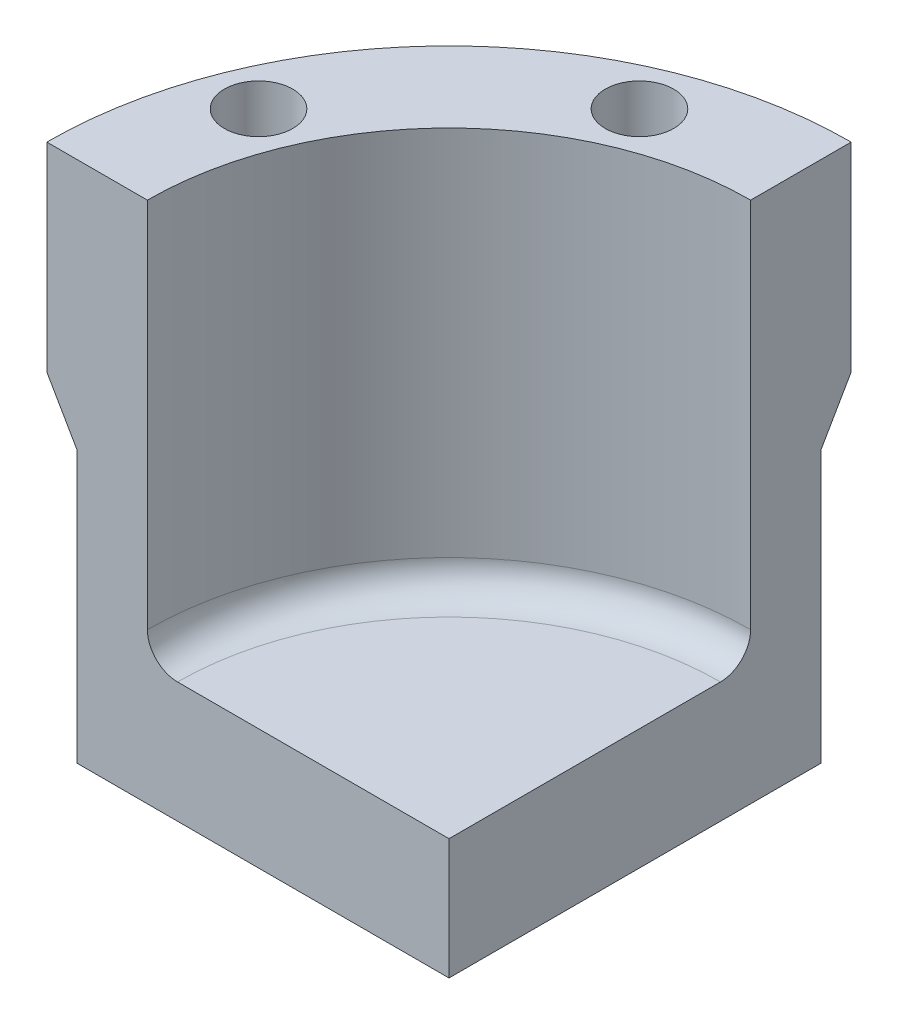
ISO-10303-21;
HEADER;
FILE_DESCRIPTION(('STEP AP214'),'2;1');
FILE_NAME('part.step','',(''),(''),'','','');
FILE_SCHEMA(('AUTOMOTIVE_DESIGN { 1 0 10303 214 1 1 1 1 }'));
ENDSEC;
DATA;
#1=APPLICATION_CONTEXT('core data for automotive mechanical design processes');
#2=APPLICATION_PROTOCOL_DEFINITION('international standard','automotive_design',2000,#1);
#3=PRODUCT_CONTEXT('',#1,'mechanical');
#4=PRODUCT('Part','Part','',(#3));
#5=PRODUCT_RELATED_PRODUCT_CATEGORY('part','',(#4));
#6=PRODUCT_DEFINITION_FORMATION('','',#4);
#7=PRODUCT_DEFINITION_CONTEXT('part definition',#1,'design');
#8=PRODUCT_DEFINITION('design','',#6,#7);
#9=PRODUCT_DEFINITION_SHAPE('','',#8);
#10=(LENGTH_UNIT() NAMED_UNIT(*) SI_UNIT(.MILLI.,.METRE.));
#11=(NAMED_UNIT(*) PLANE_ANGLE_UNIT() SI_UNIT($,.RADIAN.));
#12=(NAMED_UNIT(*) SI_UNIT($,.STERADIAN.) SOLID_ANGLE_UNIT());
#13=UNCERTAINTY_MEASURE_WITH_UNIT(LENGTH_MEASURE(1.E-05),#10,'distance_accuracy_value','');
#14=(GEOMETRIC_REPRESENTATION_CONTEXT(3) GLOBAL_UNCERTAINTY_ASSIGNED_CONTEXT((#13)) GLOBAL_UNIT_ASSIGNED_CONTEXT((#10,
#11,#12)) REPRESENTATION_CONTEXT('',''));
#15=CARTESIAN_POINT('',(0.,0.,0.));
#16=DIRECTION('',(0.,0.,1.));
#17=DIRECTION('',(1.,0.,0.));
#18=AXIS2_PLACEMENT_3D('',#15,#16,#17);
#19=CARTESIAN_POINT('',(0.,0.,0.));
#20=DIRECTION('',(0.,1.,0.));
#21=DIRECTION('',(0.,0.,1.));
#22=AXIS2_PLACEMENT_3D('',#19,#20,#21);
#23=PLANE('',#22);
#24=DIRECTION('',(0.,0.,-1.));
#25=VECTOR('',#24,1.);
#26=CARTESIAN_POINT('',(0.,0.,0.));
#27=LINE('',#26,#25);
#28=CARTESIAN_POINT('',(0.,0.,0.));
#29=VERTEX_POINT('',#28);
#30=CARTESIAN_POINT('',(0.,0.,-27.));
#31=VERTEX_POINT('',#30);
#32=EDGE_CURVE('E147',#29,#31,#27,.T.);
#33=ORIENTED_EDGE('',*,*,#32,.T.);
#34=CARTESIAN_POINT('',(0.,0.,0.));
#35=DIRECTION('',(0.,1.,0.));
#36=DIRECTION('',(0.,0.,1.));
#37=AXIS2_PLACEMENT_3D('',#34,#35,#36);
#38=CIRCLE('',#37,27.);
#39=CARTESIAN_POINT('',(-27.,0.,0.));
#40=VERTEX_POINT('',#39);
#41=EDGE_CURVE('E178',#31,#40,#38,.T.);
#42=ORIENTED_EDGE('',*,*,#41,.T.);
#43=DIRECTION('',(-1.,0.,0.));
#44=VECTOR('',#43,1.);
#45=CARTESIAN_POINT('',(0.,0.,0.));
#46=LINE('',#45,#44);
#47=EDGE_CURVE('E126',#29,#40,#46,.T.);
#48=ORIENTED_EDGE('',*,*,#47,.F.);
#49=EDGE_LOOP('',(#33,#42,#48));
#50=FACE_BOUND('',#49,.T.);
#51=ADVANCED_FACE('F38',(#50),#23,.T.);
#52=CARTESIAN_POINT('',(0.,25.4814360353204,0.));
#53=DIRECTION('',(0.,1.,0.));
#54=DIRECTION('',(0.,0.,1.));
#55=AXIS2_PLACEMENT_3D('',#52,#53,#54);
#56=CYLINDRICAL_SURFACE('',#55,30.);
#57=DIRECTION('',(0.,1.,0.));
#58=VECTOR('',#57,1.);
#59=CARTESIAN_POINT('',(-30.,0.,0.));
#60=LINE('',#59,#58);
#61=CARTESIAN_POINT('',(-30.,3.,0.));
#62=VERTEX_POINT('',#61);
#63=CARTESIAN_POINT('',(-30.,40.,0.));
#64=VERTEX_POINT('',#63);
#65=EDGE_CURVE('E128',#62,#64,#60,.T.);
#66=ORIENTED_EDGE('',*,*,#65,.F.);
#67=CARTESIAN_POINT('',(0.,3.,0.));
#68=DIRECTION('',(0.,1.,0.));
#69=DIRECTION('',(0.,0.,1.));
#70=AXIS2_PLACEMENT_3D('',#67,#68,#69);
#71=CIRCLE('',#70,30.);
#72=CARTESIAN_POINT('',(1.04744440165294E-13,3.,-30.));
#73=VERTEX_POINT('',#72);
#74=EDGE_CURVE('E53',#62,#73,#71,.F.);
#75=ORIENTED_EDGE('',*,*,#74,.T.);
#76=DIRECTION('',(0.,1.,0.));
#77=VECTOR('',#76,1.);
#78=CARTESIAN_POINT('',(1.04744440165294E-13,0.,-30.));
#79=LINE('',#78,#77);
#80=CARTESIAN_POINT('',(1.04744440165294E-13,40.,-30.));
#81=VERTEX_POINT('',#80);
#82=EDGE_CURVE('E150',#73,#81,#79,.T.);
#83=ORIENTED_EDGE('',*,*,#82,.T.);
#84=CARTESIAN_POINT('',(0.,40.,0.));
#85=DIRECTION('',(0.,1.,0.));
#86=DIRECTION('',(0.,0.,1.));
#87=AXIS2_PLACEMENT_3D('',#84,#85,#86);
#88=CIRCLE('',#87,30.);
#89=EDGE_CURVE('E175',#81,#64,#88,.T.);
#90=ORIENTED_EDGE('',*,*,#89,.T.);
#91=EDGE_LOOP('',(#66,#75,#83,#90));
#92=FACE_BOUND('',#91,.T.);
#93=ADVANCED_FACE('F199',(#92),#56,.F.);
#94=CARTESIAN_POINT('',(1.04744440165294E-13,40.,-30.));
#95=DIRECTION('',(0.,1.,0.));
#96=DIRECTION('',(0.,0.,1.));
#97=AXIS2_PLACEMENT_3D('',#94,#95,#96);
#98=PLANE('',#97);
#99=CARTESIAN_POINT('',(-32.335783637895,40.,-13.3939201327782));
#100=DIRECTION('',(0.,1.,0.));
#101=DIRECTION('',(0.,0.,1.));
#102=AXIS2_PLACEMENT_3D('',#99,#100,#101);
#103=CIRCLE('',#102,3.4);
#104=CARTESIAN_POINT('',(-32.335783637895,40.,-9.99392013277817));
#105=VERTEX_POINT('',#104);
#106=EDGE_CURVE('E116',#105,#105,#103,.T.);
#107=ORIENTED_EDGE('',*,*,#106,.F.);
#108=EDGE_LOOP('',(#107));
#109=FACE_BOUND('',#108,.T.);
#110=CARTESIAN_POINT('',(-13.3939201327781,40.,-32.3357836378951));
#111=DIRECTION('',(0.,1.,0.));
#112=DIRECTION('',(0.,0.,1.));
#113=AXIS2_PLACEMENT_3D('',#110,#111,#112);
#114=CIRCLE('',#113,3.4);
#115=CARTESIAN_POINT('',(-13.3939201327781,40.,-28.9357836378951));
#116=VERTEX_POINT('',#115);
#117=EDGE_CURVE('E115',#116,#116,#114,.T.);
#118=ORIENTED_EDGE('',*,*,#117,.F.);
#119=EDGE_LOOP('',(#118));
#120=FACE_BOUND('',#119,.T.);
#121=CARTESIAN_POINT('',(0.,40.,0.));
#122=DIRECTION('',(0.,1.,0.));
#123=DIRECTION('',(0.,0.,1.));
#124=AXIS2_PLACEMENT_3D('',#121,#122,#123);
#125=CIRCLE('',#124,40.);
#126=CARTESIAN_POINT('',(1.39659253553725E-13,40.,-40.));
#127=VERTEX_POINT('',#126);
#128=CARTESIAN_POINT('',(-40.,40.,0.));
#129=VERTEX_POINT('',#128);
#130=EDGE_CURVE('E173',#127,#129,#125,.T.);
#131=ORIENTED_EDGE('',*,*,#130,.T.);
#132=DIRECTION('',(-1.,0.,0.));
#133=VECTOR('',#132,1.);
#134=CARTESIAN_POINT('',(-30.,40.,0.));
#135=LINE('',#134,#133);
#136=EDGE_CURVE('E130',#64,#129,#135,.T.);
#137=ORIENTED_EDGE('',*,*,#136,.F.);
#138=ORIENTED_EDGE('',*,*,#89,.F.);
#139=DIRECTION('',(0.,0.,-1.));
#140=VECTOR('',#139,1.);
#141=CARTESIAN_POINT('',(1.04744440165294E-13,40.,-30.));
#142=LINE('',#141,#140);
#143=EDGE_CURVE('E152',#81,#127,#142,.T.);
#144=ORIENTED_EDGE('',*,*,#143,.T.);
#145=EDGE_LOOP('',(#131,#137,#138,#144));
#146=FACE_BOUND('',#145,.T.);
#147=ADVANCED_FACE('F203',(#109,#120,#146),#98,.T.);
#148=CARTESIAN_POINT('',(0.,25.4814360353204,0.));
#149=DIRECTION('',(0.,1.,0.));
#150=DIRECTION('',(0.,0.,1.));
#151=AXIS2_PLACEMENT_3D('',#148,#149,#150);
#152=CYLINDRICAL_SURFACE('',#151,40.);
#153=CARTESIAN_POINT('',(0.,20.1961524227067,0.));
#154=DIRECTION('',(0.,1.,0.));
#155=DIRECTION('',(0.,0.,1.));
#156=AXIS2_PLACEMENT_3D('',#153,#154,#155);
#157=CIRCLE('',#156,40.);
#158=CARTESIAN_POINT('',(1.39659253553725E-13,20.1961524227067,-40.));
#159=VERTEX_POINT('',#158);
#160=CARTESIAN_POINT('',(-40.,20.1961524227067,0.));
#161=VERTEX_POINT('',#160);
#162=EDGE_CURVE('E171',#159,#161,#157,.T.);
#163=ORIENTED_EDGE('',*,*,#162,.T.);
#164=DIRECTION('',(0.,-1.,0.));
#165=VECTOR('',#164,1.);
#166=CARTESIAN_POINT('',(-40.,40.,0.));
#167=LINE('',#166,#165);
#168=EDGE_CURVE('E133',#129,#161,#167,.T.);
#169=ORIENTED_EDGE('',*,*,#168,.F.);
#170=ORIENTED_EDGE('',*,*,#130,.F.);
#171=DIRECTION('',(0.,-1.,0.));
#172=VECTOR('',#171,1.);
#173=CARTESIAN_POINT('',(1.39659253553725E-13,40.,-40.));
#174=LINE('',#173,#172);
#175=EDGE_CURVE('E155',#127,#159,#174,.T.);
#176=ORIENTED_EDGE('',*,*,#175,.T.);
#177=EDGE_LOOP('',(#163,#169,#170,#176));
#178=FACE_BOUND('',#177,.T.);
#179=ADVANCED_FACE('F208',(#178),#152,.T.);
#180=CARTESIAN_POINT('',(0.,20.1961524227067,0.));
#181=DIRECTION('',(0.,1.,0.));
#182=DIRECTION('',(0.,0.,1.));
#183=AXIS2_PLACEMENT_3D('',#180,#181,#182);
#184=CONICAL_SURFACE('',#183,40.,0.523598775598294);
#185=CARTESIAN_POINT('',(0.,15.,0.));
#186=DIRECTION('',(0.,1.,0.));
#187=DIRECTION('',(0.,0.,1.));
#188=AXIS2_PLACEMENT_3D('',#185,#186,#187);
#189=CIRCLE('',#188,37.);
#190=CARTESIAN_POINT('',(1.29184809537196E-13,15.,-37.));
#191=VERTEX_POINT('',#190);
#192=CARTESIAN_POINT('',(-37.,15.,0.));
#193=VERTEX_POINT('',#192);
#194=EDGE_CURVE('E169',#191,#193,#189,.T.);
#195=ORIENTED_EDGE('',*,*,#194,.T.);
#196=DIRECTION('',(0.499999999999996,-0.866025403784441,0.));
#197=VECTOR('',#196,1.);
#198=CARTESIAN_POINT('',(-40.,20.1961524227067,0.));
#199=LINE('',#198,#197);
#200=EDGE_CURVE('E136',#161,#193,#199,.T.);
#201=ORIENTED_EDGE('',*,*,#200,.F.);
#202=ORIENTED_EDGE('',*,*,#162,.F.);
#203=DIRECTION('',(0.,-0.866025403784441,0.499999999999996));
#204=VECTOR('',#203,1.);
#205=CARTESIAN_POINT('',(1.39659253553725E-13,20.1961524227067,-40.));
#206=LINE('',#205,#204);
#207=EDGE_CURVE('E158',#159,#191,#206,.T.);
#208=ORIENTED_EDGE('',*,*,#207,.T.);
#209=EDGE_LOOP('',(#195,#201,#202,#208));
#210=FACE_BOUND('',#209,.T.);
#211=ADVANCED_FACE('F212',(#210),#184,.T.);
#212=CARTESIAN_POINT('',(0.,25.4814360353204,0.));
#213=DIRECTION('',(0.,1.,0.));
#214=DIRECTION('',(0.,0.,1.));
#215=AXIS2_PLACEMENT_3D('',#212,#213,#214);
#216=CYLINDRICAL_SURFACE('',#215,37.);
#217=CARTESIAN_POINT('',(0.,-12.,0.));
#218=DIRECTION('',(0.,1.,0.));
#219=DIRECTION('',(0.,0.,1.));
#220=AXIS2_PLACEMENT_3D('',#217,#218,#219);
#221=CIRCLE('',#220,37.);
#222=CARTESIAN_POINT('',(1.29184809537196E-13,-12.,-37.));
#223=VERTEX_POINT('',#222);
#224=CARTESIAN_POINT('',(-37.,-12.,0.));
#225=VERTEX_POINT('',#224);
#226=EDGE_CURVE('E167',#223,#225,#221,.T.);
#227=ORIENTED_EDGE('',*,*,#226,.T.);
#228=DIRECTION('',(0.,-1.,0.));
#229=VECTOR('',#228,1.);
#230=CARTESIAN_POINT('',(-37.,15.,0.));
#231=LINE('',#230,#229);
#232=EDGE_CURVE('E139',#193,#225,#231,.T.);
#233=ORIENTED_EDGE('',*,*,#232,.F.);
#234=ORIENTED_EDGE('',*,*,#194,.F.);
#235=DIRECTION('',(0.,-1.,0.));
#236=VECTOR('',#235,1.);
#237=CARTESIAN_POINT('',(1.29184809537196E-13,15.,-37.));
#238=LINE('',#237,#236);
#239=EDGE_CURVE('E161',#191,#223,#238,.T.);
#240=ORIENTED_EDGE('',*,*,#239,.T.);
#241=EDGE_LOOP('',(#227,#233,#234,#240));
#242=FACE_BOUND('',#241,.T.);
#243=ADVANCED_FACE('F216',(#242),#216,.T.);
#244=CARTESIAN_POINT('',(1.29184809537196E-13,-12.,-37.));
#245=DIRECTION('',(0.,-1.,0.));
#246=DIRECTION('',(0.,0.,-1.));
#247=AXIS2_PLACEMENT_3D('',#244,#245,#246);
#248=PLANE('',#247);
#249=DIRECTION('',(0.,0.,1.));
#250=VECTOR('',#249,1.);
#251=CARTESIAN_POINT('',(1.29184809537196E-13,-12.,-37.));
#252=LINE('',#251,#250);
#253=CARTESIAN_POINT('',(0.,-12.,0.));
#254=VERTEX_POINT('',#253);
#255=EDGE_CURVE('E164',#223,#254,#252,.T.);
#256=ORIENTED_EDGE('',*,*,#255,.T.);
#257=DIRECTION('',(1.,0.,0.));
#258=VECTOR('',#257,1.);
#259=CARTESIAN_POINT('',(-37.,-12.,0.));
#260=LINE('',#259,#258);
#261=EDGE_CURVE('E142',#225,#254,#260,.T.);
#262=ORIENTED_EDGE('',*,*,#261,.F.);
#263=ORIENTED_EDGE('',*,*,#226,.F.);
#264=EDGE_LOOP('',(#256,#262,#263));
#265=FACE_BOUND('',#264,.T.);
#266=ADVANCED_FACE('F220',(#265),#248,.T.);
#267=CARTESIAN_POINT('',(0.,0.,0.));
#268=DIRECTION('',(-1.,0.,0.));
#269=DIRECTION('',(0.,0.,1.));
#270=AXIS2_PLACEMENT_3D('',#267,#268,#269);
#271=PLANE('',#270);
#272=DIRECTION('',(0.,1.,0.));
#273=VECTOR('',#272,1.);
#274=CARTESIAN_POINT('',(0.,-12.,0.));
#275=LINE('',#274,#273);
#276=EDGE_CURVE('E144',#254,#29,#275,.T.);
#277=ORIENTED_EDGE('',*,*,#276,.F.);
#278=ORIENTED_EDGE('',*,*,#255,.F.);
#279=ORIENTED_EDGE('',*,*,#239,.F.);
#280=ORIENTED_EDGE('',*,*,#207,.F.);
#281=ORIENTED_EDGE('',*,*,#175,.F.);
#282=ORIENTED_EDGE('',*,*,#143,.F.);
#283=ORIENTED_EDGE('',*,*,#82,.F.);
#284=CARTESIAN_POINT('',(0.,3.,-27.));
#285=DIRECTION('',(-1.,0.,0.));
#286=DIRECTION('',(0.,0.,1.));
#287=AXIS2_PLACEMENT_3D('',#284,#285,#286);
#288=CIRCLE('',#287,3.);
#289=EDGE_CURVE('E11',#73,#31,#288,.T.);
#290=ORIENTED_EDGE('',*,*,#289,.T.);
#291=ORIENTED_EDGE('',*,*,#32,.F.);
#292=EDGE_LOOP('',(#277,#278,#279,#280,#281,#282,#283,#290,#291));
#293=FACE_BOUND('',#292,.T.);
#294=ADVANCED_FACE('F191',(#293),#271,.F.);
#295=CARTESIAN_POINT('',(0.,0.,0.));
#296=DIRECTION('',(0.,0.,1.));
#297=DIRECTION('',(1.,0.,0.));
#298=AXIS2_PLACEMENT_3D('',#295,#296,#297);
#299=PLANE('',#298);
#300=ORIENTED_EDGE('',*,*,#276,.T.);
#301=ORIENTED_EDGE('',*,*,#47,.T.);
#302=CARTESIAN_POINT('',(-27.,3.,0.));
#303=DIRECTION('',(0.,0.,1.));
#304=DIRECTION('',(1.,0.,0.));
#305=AXIS2_PLACEMENT_3D('',#302,#303,#304);
#306=CIRCLE('',#305,3.);
#307=EDGE_CURVE('E46',#40,#62,#306,.F.);
#308=ORIENTED_EDGE('',*,*,#307,.T.);
#309=ORIENTED_EDGE('',*,*,#65,.T.);
#310=ORIENTED_EDGE('',*,*,#136,.T.);
#311=ORIENTED_EDGE('',*,*,#168,.T.);
#312=ORIENTED_EDGE('',*,*,#200,.T.);
#313=ORIENTED_EDGE('',*,*,#232,.T.);
#314=ORIENTED_EDGE('',*,*,#261,.T.);
#315=EDGE_LOOP('',(#300,#301,#308,#309,#310,#311,#312,#313,#314));
#316=FACE_BOUND('',#315,.T.);
#317=ADVANCED_FACE('F186',(#316),#299,.T.);
#318=CARTESIAN_POINT('',(-13.3939201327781,17.75,-32.3357836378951));
#319=DIRECTION('',(0.,1.,0.));
#320=DIRECTION('',(0.,0.,1.));
#321=AXIS2_PLACEMENT_3D('',#318,#319,#320);
#322=CONICAL_SURFACE('',#321,3.4,1.02974425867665);
#323=CARTESIAN_POINT('',(-13.3939201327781,15.7070738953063,-32.3357836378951));
#324=VERTEX_POINT('',#323);
#325=VERTEX_LOOP('',#324);
#326=FACE_BOUND('',#325,.T.);
#327=CARTESIAN_POINT('',(-13.3939201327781,17.75,-32.3357836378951));
#328=DIRECTION('',(0.,1.,0.));
#329=DIRECTION('',(0.,0.,1.));
#330=AXIS2_PLACEMENT_3D('',#327,#328,#329);
#331=CIRCLE('',#330,3.4);
#332=CARTESIAN_POINT('',(-13.3939201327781,17.75,-28.9357836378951));
#333=VERTEX_POINT('',#332);
#334=EDGE_CURVE('E119',#333,#333,#331,.T.);
#335=ORIENTED_EDGE('',*,*,#334,.T.);
#336=EDGE_LOOP('',(#335));
#337=FACE_BOUND('',#336,.T.);
#338=ADVANCED_FACE('F229',(#326,#337),#322,.F.);
#339=CARTESIAN_POINT('',(-13.3939201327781,40.,-32.3357836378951));
#340=DIRECTION('',(0.,1.,0.));
#341=DIRECTION('',(0.,0.,1.));
#342=AXIS2_PLACEMENT_3D('',#339,#340,#341);
#343=CYLINDRICAL_SURFACE('',#342,3.4);
#344=ORIENTED_EDGE('',*,*,#334,.F.);
#345=EDGE_LOOP('',(#344));
#346=FACE_BOUND('',#345,.T.);
#347=ORIENTED_EDGE('',*,*,#117,.T.);
#348=EDGE_LOOP('',(#347));
#349=FACE_BOUND('',#348,.T.);
#350=ADVANCED_FACE('F109',(#346,#349),#343,.F.);
#351=CARTESIAN_POINT('',(-32.335783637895,17.75,-13.3939201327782));
#352=DIRECTION('',(0.,1.,0.));
#353=DIRECTION('',(0.,0.,1.));
#354=AXIS2_PLACEMENT_3D('',#351,#352,#353);
#355=CONICAL_SURFACE('',#354,3.4,1.02974425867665);
#356=CARTESIAN_POINT('',(-32.335783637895,15.7070738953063,-13.3939201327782));
#357=VERTEX_POINT('',#356);
#358=VERTEX_LOOP('',#357);
#359=FACE_BOUND('',#358,.T.);
#360=CARTESIAN_POINT('',(-32.335783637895,17.75,-13.3939201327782));
#361=DIRECTION('',(0.,1.,0.));
#362=DIRECTION('',(0.,0.,1.));
#363=AXIS2_PLACEMENT_3D('',#360,#361,#362);
#364=CIRCLE('',#363,3.4);
#365=CARTESIAN_POINT('',(-32.335783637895,17.75,-9.99392013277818));
#366=VERTEX_POINT('',#365);
#367=EDGE_CURVE('E113',#366,#366,#364,.T.);
#368=ORIENTED_EDGE('',*,*,#367,.T.);
#369=EDGE_LOOP('',(#368));
#370=FACE_BOUND('',#369,.T.);
#371=ADVANCED_FACE('F105',(#359,#370),#355,.F.);
#372=CARTESIAN_POINT('',(-32.335783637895,40.,-13.3939201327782));
#373=DIRECTION('',(0.,1.,0.));
#374=DIRECTION('',(0.,0.,1.));
#375=AXIS2_PLACEMENT_3D('',#372,#373,#374);
#376=CYLINDRICAL_SURFACE('',#375,3.4);
#377=ORIENTED_EDGE('',*,*,#367,.F.);
#378=EDGE_LOOP('',(#377));
#379=FACE_BOUND('',#378,.T.);
#380=ORIENTED_EDGE('',*,*,#106,.T.);
#381=EDGE_LOOP('',(#380));
#382=FACE_BOUND('',#381,.T.);
#383=ADVANCED_FACE('F108',(#379,#382),#376,.F.);
#384=CARTESIAN_POINT('',(0.,3.,0.));
#385=DIRECTION('',(0.,1.,0.));
#386=DIRECTION('',(0.,0.,1.));
#387=AXIS2_PLACEMENT_3D('',#384,#385,#386);
#388=TOROIDAL_SURFACE('',#387,27.,3.);
#389=ORIENTED_EDGE('',*,*,#289,.F.);
#390=ORIENTED_EDGE('',*,*,#74,.F.);
#391=ORIENTED_EDGE('',*,*,#307,.F.);
#392=ORIENTED_EDGE('',*,*,#41,.F.);
#393=EDGE_LOOP('',(#389,#390,#391,#392));
#394=FACE_BOUND('',#393,.T.);
#395=ADVANCED_FACE('F40',(#394),#388,.F.);
#396=CLOSED_SHELL('',(#51,#93,#147,#179,#211,#243,#266,#294,#317,#338,#350,#371,#383,#395));
#397=MANIFOLD_SOLID_BREP('B2',#396);
#398=ADVANCED_BREP_SHAPE_REPRESENTATION('',(#18,#397),#14);
#399=SHAPE_DEFINITION_REPRESENTATION(#9,#398);
ENDSEC;
END-ISO-10303-21;
